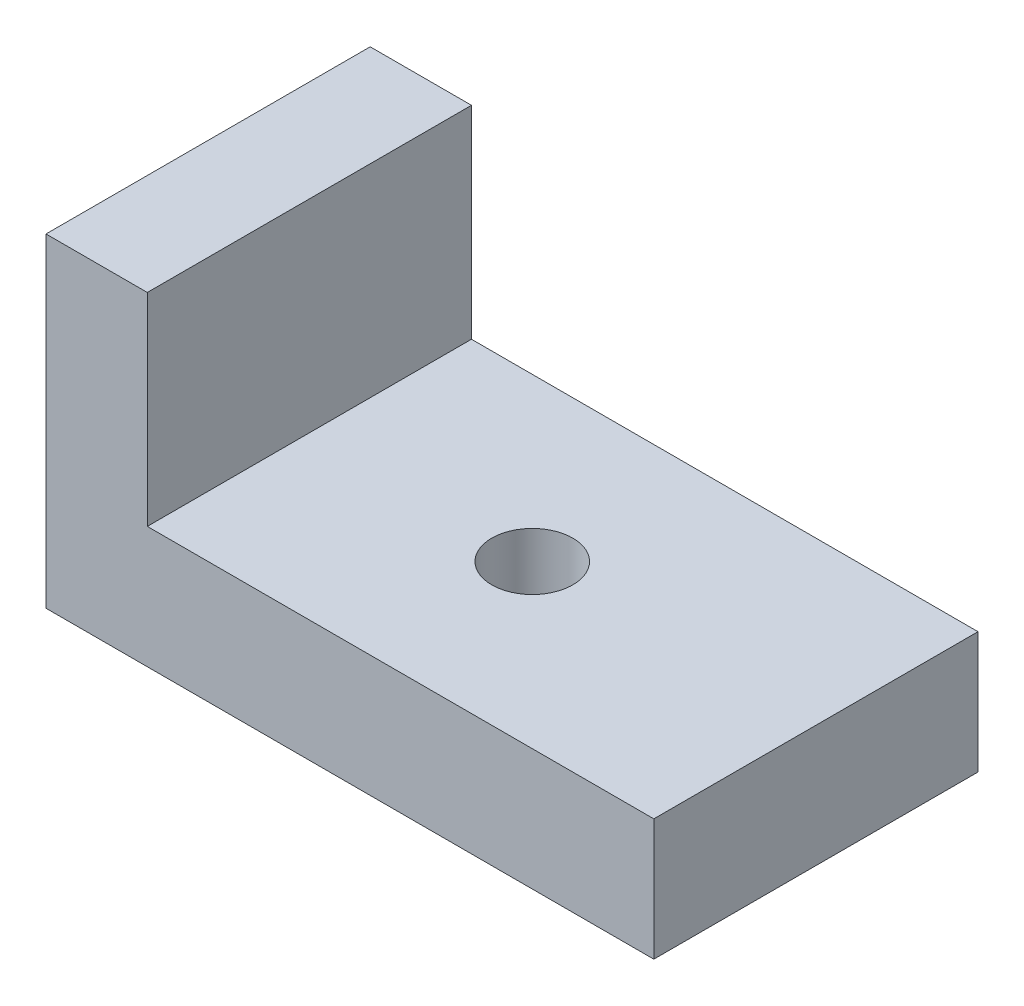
ISO-10303-21;
HEADER;
FILE_DESCRIPTION(('STEP AP214'),'2;1');
FILE_NAME('part.step','',(''),(''),'','','');
FILE_SCHEMA(('AUTOMOTIVE_DESIGN { 1 0 10303 214 1 1 1 1 }'));
ENDSEC;
DATA;
#1=APPLICATION_CONTEXT('core data for automotive mechanical design processes');
#2=APPLICATION_PROTOCOL_DEFINITION('international standard','automotive_design',2000,#1);
#3=PRODUCT_CONTEXT('',#1,'mechanical');
#4=PRODUCT('Part','Part','',(#3));
#5=PRODUCT_RELATED_PRODUCT_CATEGORY('part','',(#4));
#6=PRODUCT_DEFINITION_FORMATION('','',#4);
#7=PRODUCT_DEFINITION_CONTEXT('part definition',#1,'design');
#8=PRODUCT_DEFINITION('design','',#6,#7);
#9=PRODUCT_DEFINITION_SHAPE('','',#8);
#10=(LENGTH_UNIT() NAMED_UNIT(*) SI_UNIT(.MILLI.,.METRE.));
#11=(NAMED_UNIT(*) PLANE_ANGLE_UNIT() SI_UNIT($,.RADIAN.));
#12=(NAMED_UNIT(*) SI_UNIT($,.STERADIAN.) SOLID_ANGLE_UNIT());
#13=UNCERTAINTY_MEASURE_WITH_UNIT(LENGTH_MEASURE(1.E-05),#10,'distance_accuracy_value','');
#14=(GEOMETRIC_REPRESENTATION_CONTEXT(3) GLOBAL_UNCERTAINTY_ASSIGNED_CONTEXT((#13)) GLOBAL_UNIT_ASSIGNED_CONTEXT((#10,
#11,#12)) REPRESENTATION_CONTEXT('',''));
#15=CARTESIAN_POINT('',(0.,0.,0.));
#16=DIRECTION('',(0.,0.,1.));
#17=DIRECTION('',(1.,0.,0.));
#18=AXIS2_PLACEMENT_3D('',#15,#16,#17);
#19=CARTESIAN_POINT('',(-37.5598909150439,21.4863345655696,40.));
#20=DIRECTION('',(-1.,0.,0.));
#21=DIRECTION('',(0.,0.,1.));
#22=AXIS2_PLACEMENT_3D('',#19,#20,#21);
#23=PLANE('',#22);
#24=DIRECTION('',(0.,1.,0.));
#25=VECTOR('',#24,1.);
#26=CARTESIAN_POINT('',(-37.5598909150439,21.4863345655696,-40.));
#27=LINE('',#26,#25);
#28=CARTESIAN_POINT('',(-37.5598909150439,21.4863345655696,-40.));
#29=VERTEX_POINT('',#28);
#30=CARTESIAN_POINT('',(-37.5598909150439,71.4863345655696,-40.));
#31=VERTEX_POINT('',#30);
#32=EDGE_CURVE('E87',#29,#31,#27,.T.);
#33=ORIENTED_EDGE('',*,*,#32,.T.);
#34=DIRECTION('',(0.,0.,-1.));
#35=VECTOR('',#34,1.);
#36=CARTESIAN_POINT('',(-37.5598909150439,71.4863345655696,40.));
#37=LINE('',#36,#35);
#38=CARTESIAN_POINT('',(-37.5598909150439,71.4863345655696,40.));
#39=VERTEX_POINT('',#38);
#40=EDGE_CURVE('E11',#39,#31,#37,.T.);
#41=ORIENTED_EDGE('',*,*,#40,.F.);
#42=DIRECTION('',(0.,1.,0.));
#43=VECTOR('',#42,1.);
#44=CARTESIAN_POINT('',(-37.5598909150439,21.4863345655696,40.));
#45=LINE('',#44,#43);
#46=CARTESIAN_POINT('',(-37.5598909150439,21.4863345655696,40.));
#47=VERTEX_POINT('',#46);
#48=EDGE_CURVE('E115',#47,#39,#45,.T.);
#49=ORIENTED_EDGE('',*,*,#48,.F.);
#50=DIRECTION('',(0.,0.,-1.));
#51=VECTOR('',#50,1.);
#52=CARTESIAN_POINT('',(-37.5598909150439,21.4863345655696,40.));
#53=LINE('',#52,#51);
#54=EDGE_CURVE('E100',#47,#29,#53,.T.);
#55=ORIENTED_EDGE('',*,*,#54,.T.);
#56=EDGE_LOOP('',(#33,#41,#49,#55));
#57=FACE_BOUND('',#56,.T.);
#58=ADVANCED_FACE('F31',(#57),#23,.F.);
#59=CARTESIAN_POINT('',(-37.5598909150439,71.4863345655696,40.));
#60=DIRECTION('',(0.,-1.,0.));
#61=DIRECTION('',(0.,0.,-1.));
#62=AXIS2_PLACEMENT_3D('',#59,#60,#61);
#63=PLANE('',#62);
#64=DIRECTION('',(-1.,0.,0.));
#65=VECTOR('',#64,1.);
#66=CARTESIAN_POINT('',(-37.5598909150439,71.4863345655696,-40.));
#67=LINE('',#66,#65);
#68=CARTESIAN_POINT('',(-62.559890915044,71.4863345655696,-40.));
#69=VERTEX_POINT('',#68);
#70=EDGE_CURVE('E83',#31,#69,#67,.T.);
#71=ORIENTED_EDGE('',*,*,#70,.T.);
#72=DIRECTION('',(0.,0.,-1.));
#73=VECTOR('',#72,1.);
#74=CARTESIAN_POINT('',(-62.559890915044,71.4863345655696,40.));
#75=LINE('',#74,#73);
#76=CARTESIAN_POINT('',(-62.559890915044,71.4863345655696,40.));
#77=VERTEX_POINT('',#76);
#78=EDGE_CURVE('E38',#77,#69,#75,.T.);
#79=ORIENTED_EDGE('',*,*,#78,.F.);
#80=DIRECTION('',(-1.,0.,0.));
#81=VECTOR('',#80,1.);
#82=CARTESIAN_POINT('',(-37.5598909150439,71.4863345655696,40.));
#83=LINE('',#82,#81);
#84=EDGE_CURVE('E96',#39,#77,#83,.T.);
#85=ORIENTED_EDGE('',*,*,#84,.F.);
#86=ORIENTED_EDGE('',*,*,#40,.T.);
#87=EDGE_LOOP('',(#71,#79,#85,#86));
#88=FACE_BOUND('',#87,.T.);
#89=ADVANCED_FACE('F95',(#88),#63,.F.);
#90=CARTESIAN_POINT('',(-62.559890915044,71.4863345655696,40.));
#91=DIRECTION('',(1.,0.,0.));
#92=DIRECTION('',(0.,1.,0.));
#93=AXIS2_PLACEMENT_3D('',#90,#91,#92);
#94=PLANE('',#93);
#95=DIRECTION('',(0.,-1.,0.));
#96=VECTOR('',#95,1.);
#97=CARTESIAN_POINT('',(-62.559890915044,71.4863345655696,-40.));
#98=LINE('',#97,#96);
#99=CARTESIAN_POINT('',(-62.5598909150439,-8.51366543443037,-40.));
#100=VERTEX_POINT('',#99);
#101=EDGE_CURVE('E89',#69,#100,#98,.T.);
#102=ORIENTED_EDGE('',*,*,#101,.T.);
#103=DIRECTION('',(0.,0.,-1.));
#104=VECTOR('',#103,1.);
#105=CARTESIAN_POINT('',(-62.5598909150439,-8.51366543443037,40.));
#106=LINE('',#105,#104);
#107=CARTESIAN_POINT('',(-62.5598909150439,-8.51366543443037,40.));
#108=VERTEX_POINT('',#107);
#109=EDGE_CURVE('E131',#108,#100,#106,.T.);
#110=ORIENTED_EDGE('',*,*,#109,.F.);
#111=DIRECTION('',(0.,-1.,0.));
#112=VECTOR('',#111,1.);
#113=CARTESIAN_POINT('',(-62.559890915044,71.4863345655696,40.));
#114=LINE('',#113,#112);
#115=EDGE_CURVE('E118',#77,#108,#114,.T.);
#116=ORIENTED_EDGE('',*,*,#115,.F.);
#117=ORIENTED_EDGE('',*,*,#78,.T.);
#118=EDGE_LOOP('',(#102,#110,#116,#117));
#119=FACE_BOUND('',#118,.T.);
#120=ADVANCED_FACE('F135',(#119),#94,.F.);
#121=CARTESIAN_POINT('',(-62.5598909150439,-8.51366543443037,40.));
#122=DIRECTION('',(0.,1.,0.));
#123=DIRECTION('',(0.,0.,1.));
#124=AXIS2_PLACEMENT_3D('',#121,#122,#123);
#125=PLANE('',#124);
#126=CARTESIAN_POINT('',(17.4401090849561,-8.51366543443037,0.));
#127=DIRECTION('',(0.,1.,0.));
#128=DIRECTION('',(0.,0.,1.));
#129=AXIS2_PLACEMENT_3D('',#126,#127,#128);
#130=CIRCLE('',#129,10.);
#131=CARTESIAN_POINT('',(17.4401090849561,-8.51366543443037,10.));
#132=VERTEX_POINT('',#131);
#133=EDGE_CURVE('E101',#132,#132,#130,.T.);
#134=ORIENTED_EDGE('',*,*,#133,.T.);
#135=EDGE_LOOP('',(#134));
#136=FACE_BOUND('',#135,.T.);
#137=DIRECTION('',(1.,0.,0.));
#138=VECTOR('',#137,1.);
#139=CARTESIAN_POINT('',(-62.5598909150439,-8.51366543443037,-40.));
#140=LINE('',#139,#138);
#141=CARTESIAN_POINT('',(87.4401090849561,-8.51366543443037,-40.));
#142=VERTEX_POINT('',#141);
#143=EDGE_CURVE('E109',#100,#142,#140,.T.);
#144=ORIENTED_EDGE('',*,*,#143,.T.);
#145=DIRECTION('',(0.,0.,-1.));
#146=VECTOR('',#145,1.);
#147=CARTESIAN_POINT('',(87.4401090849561,-8.51366543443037,40.));
#148=LINE('',#147,#146);
#149=CARTESIAN_POINT('',(87.4401090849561,-8.51366543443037,40.));
#150=VERTEX_POINT('',#149);
#151=EDGE_CURVE('E128',#150,#142,#148,.T.);
#152=ORIENTED_EDGE('',*,*,#151,.F.);
#153=DIRECTION('',(1.,0.,0.));
#154=VECTOR('',#153,1.);
#155=CARTESIAN_POINT('',(-62.5598909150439,-8.51366543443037,40.));
#156=LINE('',#155,#154);
#157=EDGE_CURVE('E120',#108,#150,#156,.T.);
#158=ORIENTED_EDGE('',*,*,#157,.F.);
#159=ORIENTED_EDGE('',*,*,#109,.T.);
#160=EDGE_LOOP('',(#144,#152,#158,#159));
#161=FACE_BOUND('',#160,.T.);
#162=ADVANCED_FACE('F141',(#136,#161),#125,.F.);
#163=CARTESIAN_POINT('',(87.4401090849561,-8.51366543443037,40.));
#164=DIRECTION('',(-1.,0.,0.));
#165=DIRECTION('',(0.,0.,1.));
#166=AXIS2_PLACEMENT_3D('',#163,#164,#165);
#167=PLANE('',#166);
#168=DIRECTION('',(0.,1.,0.));
#169=VECTOR('',#168,1.);
#170=CARTESIAN_POINT('',(87.4401090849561,-8.51366543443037,-40.));
#171=LINE('',#170,#169);
#172=CARTESIAN_POINT('',(87.4401090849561,21.4863345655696,-40.));
#173=VERTEX_POINT('',#172);
#174=EDGE_CURVE('E111',#142,#173,#171,.T.);
#175=ORIENTED_EDGE('',*,*,#174,.T.);
#176=DIRECTION('',(0.,0.,-1.));
#177=VECTOR('',#176,1.);
#178=CARTESIAN_POINT('',(87.4401090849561,21.4863345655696,40.));
#179=LINE('',#178,#177);
#180=CARTESIAN_POINT('',(87.4401090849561,21.4863345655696,40.));
#181=VERTEX_POINT('',#180);
#182=EDGE_CURVE('E125',#181,#173,#179,.T.);
#183=ORIENTED_EDGE('',*,*,#182,.F.);
#184=DIRECTION('',(0.,1.,0.));
#185=VECTOR('',#184,1.);
#186=CARTESIAN_POINT('',(87.4401090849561,-8.51366543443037,40.));
#187=LINE('',#186,#185);
#188=EDGE_CURVE('E50',#150,#181,#187,.T.);
#189=ORIENTED_EDGE('',*,*,#188,.F.);
#190=ORIENTED_EDGE('',*,*,#151,.T.);
#191=EDGE_LOOP('',(#175,#183,#189,#190));
#192=FACE_BOUND('',#191,.T.);
#193=ADVANCED_FACE('F144',(#192),#167,.F.);
#194=CARTESIAN_POINT('',(87.4401090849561,21.4863345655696,40.));
#195=DIRECTION('',(0.,-1.,0.));
#196=DIRECTION('',(1.,0.,0.));
#197=AXIS2_PLACEMENT_3D('',#194,#195,#196);
#198=PLANE('',#197);
#199=CARTESIAN_POINT('',(17.440109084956,21.4863345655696,0.));
#200=DIRECTION('',(0.,1.,0.));
#201=DIRECTION('',(-1.,0.,0.));
#202=AXIS2_PLACEMENT_3D('',#199,#200,#201);
#203=CIRCLE('',#202,10.);
#204=CARTESIAN_POINT('',(7.44010908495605,21.4863345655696,0.));
#205=VERTEX_POINT('',#204);
#206=EDGE_CURVE('E104',#205,#205,#203,.T.);
#207=ORIENTED_EDGE('',*,*,#206,.F.);
#208=EDGE_LOOP('',(#207));
#209=FACE_BOUND('',#208,.T.);
#210=DIRECTION('',(-1.,0.,0.));
#211=VECTOR('',#210,1.);
#212=CARTESIAN_POINT('',(87.4401090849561,21.4863345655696,-40.));
#213=LINE('',#212,#211);
#214=EDGE_CURVE('E113',#173,#29,#213,.T.);
#215=ORIENTED_EDGE('',*,*,#214,.T.);
#216=ORIENTED_EDGE('',*,*,#54,.F.);
#217=DIRECTION('',(-1.,0.,0.));
#218=VECTOR('',#217,1.);
#219=CARTESIAN_POINT('',(87.4401090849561,21.4863345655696,40.));
#220=LINE('',#219,#218);
#221=EDGE_CURVE('E45',#181,#47,#220,.T.);
#222=ORIENTED_EDGE('',*,*,#221,.F.);
#223=ORIENTED_EDGE('',*,*,#182,.T.);
#224=EDGE_LOOP('',(#215,#216,#222,#223));
#225=FACE_BOUND('',#224,.T.);
#226=ADVANCED_FACE('F146',(#209,#225),#198,.F.);
#227=CARTESIAN_POINT('',(-37.5598909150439,71.4863345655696,40.));
#228=DIRECTION('',(0.,0.,1.));
#229=DIRECTION('',(1.,0.,0.));
#230=AXIS2_PLACEMENT_3D('',#227,#228,#229);
#231=PLANE('',#230);
#232=ORIENTED_EDGE('',*,*,#48,.T.);
#233=ORIENTED_EDGE('',*,*,#84,.T.);
#234=ORIENTED_EDGE('',*,*,#115,.T.);
#235=ORIENTED_EDGE('',*,*,#157,.T.);
#236=ORIENTED_EDGE('',*,*,#188,.T.);
#237=ORIENTED_EDGE('',*,*,#221,.T.);
#238=EDGE_LOOP('',(#232,#233,#234,#235,#236,#237));
#239=FACE_BOUND('',#238,.T.);
#240=ADVANCED_FACE('F138',(#239),#231,.T.);
#241=CARTESIAN_POINT('',(-37.5598909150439,71.4863345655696,-40.));
#242=DIRECTION('',(0.,0.,1.));
#243=DIRECTION('',(1.,0.,0.));
#244=AXIS2_PLACEMENT_3D('',#241,#242,#243);
#245=PLANE('',#244);
#246=ORIENTED_EDGE('',*,*,#32,.F.);
#247=ORIENTED_EDGE('',*,*,#214,.F.);
#248=ORIENTED_EDGE('',*,*,#174,.F.);
#249=ORIENTED_EDGE('',*,*,#143,.F.);
#250=ORIENTED_EDGE('',*,*,#101,.F.);
#251=ORIENTED_EDGE('',*,*,#70,.F.);
#252=EDGE_LOOP('',(#246,#247,#248,#249,#250,#251));
#253=FACE_BOUND('',#252,.T.);
#254=ADVANCED_FACE('F84',(#253),#245,.F.);
#255=CARTESIAN_POINT('',(17.4401090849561,-58.5136654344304,0.));
#256=DIRECTION('',(0.,1.,0.));
#257=DIRECTION('',(-1.,0.,0.));
#258=AXIS2_PLACEMENT_3D('',#255,#256,#257);
#259=CYLINDRICAL_SURFACE('',#258,10.);
#260=ORIENTED_EDGE('',*,*,#206,.T.);
#261=EDGE_LOOP('',(#260));
#262=FACE_BOUND('',#261,.T.);
#263=ORIENTED_EDGE('',*,*,#133,.F.);
#264=EDGE_LOOP('',(#263));
#265=FACE_BOUND('',#264,.T.);
#266=ADVANCED_FACE('F172',(#262,#265),#259,.F.);
#267=CLOSED_SHELL('',(#58,#89,#120,#162,#193,#226,#240,#254,#266));
#268=MANIFOLD_SOLID_BREP('B2',#267);
#269=ADVANCED_BREP_SHAPE_REPRESENTATION('',(#18,#268),#14);
#270=SHAPE_DEFINITION_REPRESENTATION(#9,#269);
ENDSEC;
END-ISO-10303-21;
